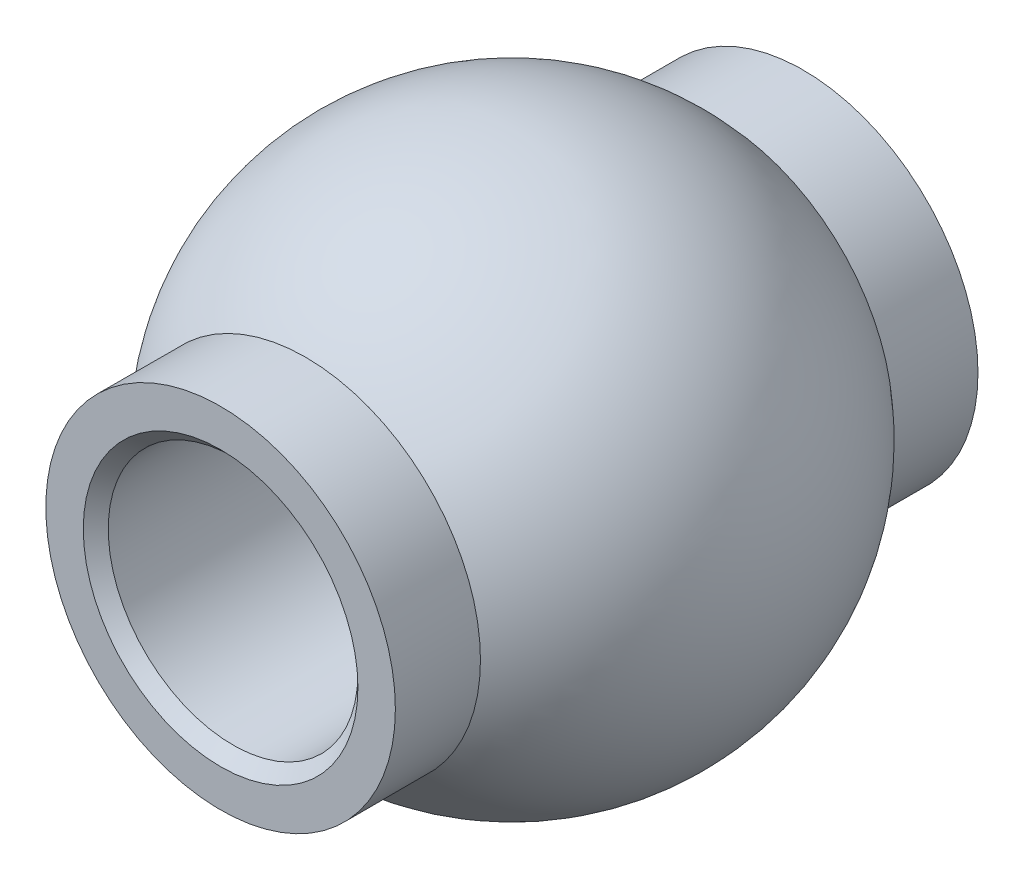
from build123d import *

# Parameters (mm, degrees)
EXTRUDE1_DEPTH          = 11.1125
EXTRUDE1_DEPTH_BACK     = 11.1125
SKETCH12_R              = 6.6675
CUT_EXTRUDE4_DEPTH      = 41.26308225
CUT_EXTRUDE4_DEPTH_BACK = 41.26308225
SKETCH10_R              = 4.7625
CHAMFER1_SIZE           = 0.47625


with BuildPart() as part:
    # Sketch7 → Revolve3 (revolve)
    with BuildSketch(Plane.XY):
        with BuildLine():
            Line((0, 37.2999), (0, 16.6751))
            ThreePointArc((0, 16.6751), (10.3124, 26.9875), (0, 37.2999))
        make_face()
    revolve(axis=Axis((0, 0, 0), (0, 1, 0)))

    # Sketch12 → Extrude1 (add, two sides: drawn at the far end of the back side and taken through both)
    with BuildSketch(Plane.XY.offset(-EXTRUDE1_DEPTH_BACK)):
        with Locations((0, 26.9875)):
            Circle(SKETCH12_R)
    extrude(amount=EXTRUDE1_DEPTH + EXTRUDE1_DEPTH_BACK)

    # Sketch10 → Cut-Extrude4 (cut, two sides: drawn at the far end of the back side and taken through both)
    with BuildSketch(Plane.XY.offset(-CUT_EXTRUDE4_DEPTH_BACK)):
        with Locations((0, 26.9875)):
            Circle(SKETCH10_R)
    extrude(amount=CUT_EXTRUDE4_DEPTH + CUT_EXTRUDE4_DEPTH_BACK, mode=Mode.SUBTRACT)

    # Chamfer1
    chamfer1_edges = [part.edges().sort_by_distance(p)[0] for p in [
        (-4.7625, 26.9875, -11.1125),
        (-4.7625, 26.9875, 11.1125),
    ]]
    chamfer(chamfer1_edges, length=CHAMFER1_SIZE)


solid = part.part
